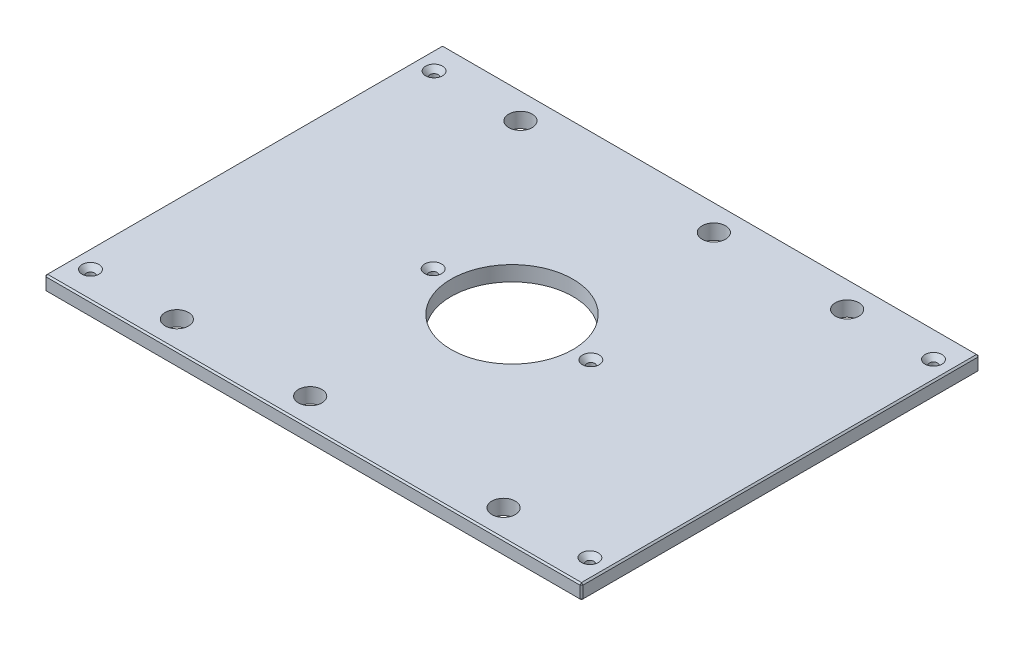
ISO-10303-21;
HEADER;
FILE_DESCRIPTION(('STEP AP214'),'2;1');
FILE_NAME('part.step','',(''),(''),'','','');
FILE_SCHEMA(('AUTOMOTIVE_DESIGN { 1 0 10303 214 1 1 1 1 }'));
ENDSEC;
DATA;
#1=APPLICATION_CONTEXT('core data for automotive mechanical design processes');
#2=APPLICATION_PROTOCOL_DEFINITION('international standard','automotive_design',2000,#1);
#3=PRODUCT_CONTEXT('',#1,'mechanical');
#4=PRODUCT('Part','Part','',(#3));
#5=PRODUCT_RELATED_PRODUCT_CATEGORY('part','',(#4));
#6=PRODUCT_DEFINITION_FORMATION('','',#4);
#7=PRODUCT_DEFINITION_CONTEXT('part definition',#1,'design');
#8=PRODUCT_DEFINITION('design','',#6,#7);
#9=PRODUCT_DEFINITION_SHAPE('','',#8);
#10=(LENGTH_UNIT() NAMED_UNIT(*) SI_UNIT(.MILLI.,.METRE.));
#11=(NAMED_UNIT(*) PLANE_ANGLE_UNIT() SI_UNIT($,.RADIAN.));
#12=(NAMED_UNIT(*) SI_UNIT($,.STERADIAN.) SOLID_ANGLE_UNIT());
#13=UNCERTAINTY_MEASURE_WITH_UNIT(LENGTH_MEASURE(1.E-05),#10,'distance_accuracy_value','');
#14=(GEOMETRIC_REPRESENTATION_CONTEXT(3) GLOBAL_UNCERTAINTY_ASSIGNED_CONTEXT((#13)) GLOBAL_UNIT_ASSIGNED_CONTEXT((#10,
#11,#12)) REPRESENTATION_CONTEXT('',''));
#15=CARTESIAN_POINT('',(0.,0.,0.));
#16=DIRECTION('',(0.,0.,1.));
#17=DIRECTION('',(1.,0.,0.));
#18=AXIS2_PLACEMENT_3D('',#15,#16,#17);
#19=CARTESIAN_POINT('',(-227.0125,12.7,-168.275));
#20=DIRECTION('',(1.,0.,0.));
#21=DIRECTION('',(0.,0.,-1.));
#22=AXIS2_PLACEMENT_3D('',#19,#20,#21);
#23=PLANE('',#22);
#24=DIRECTION('',(0.,0.,-1.));
#25=VECTOR('',#24,1.);
#26=CARTESIAN_POINT('',(-227.0125,11.4299999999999,-168.275));
#27=LINE('',#26,#25);
#28=CARTESIAN_POINT('',(-227.0125,11.4299999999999,167.005));
#29=VERTEX_POINT('',#28);
#30=CARTESIAN_POINT('',(-227.0125,11.4299999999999,-167.005));
#31=VERTEX_POINT('',#30);
#32=EDGE_CURVE('E134',#29,#31,#27,.T.);
#33=ORIENTED_EDGE('',*,*,#32,.T.);
#34=DIRECTION('',(0.,-1.,0.));
#35=VECTOR('',#34,1.);
#36=CARTESIAN_POINT('',(-227.0125,12.7,-167.005));
#37=LINE('',#36,#35);
#38=CARTESIAN_POINT('',(-227.0125,1.27000000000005,-167.005));
#39=VERTEX_POINT('',#38);
#40=EDGE_CURVE('E130',#31,#39,#37,.T.);
#41=ORIENTED_EDGE('',*,*,#40,.T.);
#42=DIRECTION('',(0.,0.,1.));
#43=VECTOR('',#42,1.);
#44=CARTESIAN_POINT('',(-227.0125,1.27000000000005,-168.275));
#45=LINE('',#44,#43);
#46=CARTESIAN_POINT('',(-227.0125,1.27000000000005,167.005));
#47=VERTEX_POINT('',#46);
#48=EDGE_CURVE('E125',#39,#47,#45,.T.);
#49=ORIENTED_EDGE('',*,*,#48,.T.);
#50=DIRECTION('',(0.,1.,0.));
#51=VECTOR('',#50,1.);
#52=CARTESIAN_POINT('',(-227.0125,12.7,167.005));
#53=LINE('',#52,#51);
#54=EDGE_CURVE('E127',#47,#29,#53,.T.);
#55=ORIENTED_EDGE('',*,*,#54,.T.);
#56=EDGE_LOOP('',(#33,#41,#49,#55));
#57=FACE_BOUND('',#56,.T.);
#58=ADVANCED_FACE('F34',(#57),#23,.F.);
#59=CARTESIAN_POINT('',(-227.0125,12.7,168.275));
#60=DIRECTION('',(0.,0.,-1.));
#61=DIRECTION('',(-1.,0.,0.));
#62=AXIS2_PLACEMENT_3D('',#59,#60,#61);
#63=PLANE('',#62);
#64=DIRECTION('',(1.,0.,0.));
#65=VECTOR('',#64,1.);
#66=CARTESIAN_POINT('',(-227.0125,1.27000000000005,168.275));
#67=LINE('',#66,#65);
#68=CARTESIAN_POINT('',(-225.7425,1.27000000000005,168.275));
#69=VERTEX_POINT('',#68);
#70=CARTESIAN_POINT('',(225.7425,1.27000000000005,168.275));
#71=VERTEX_POINT('',#70);
#72=EDGE_CURVE('E57',#69,#71,#67,.T.);
#73=ORIENTED_EDGE('',*,*,#72,.T.);
#74=DIRECTION('',(0.,1.,0.));
#75=VECTOR('',#74,1.);
#76=CARTESIAN_POINT('',(225.7425,12.7,168.275));
#77=LINE('',#76,#75);
#78=CARTESIAN_POINT('',(225.7425,11.4299999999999,168.275));
#79=VERTEX_POINT('',#78);
#80=EDGE_CURVE('E11',#71,#79,#77,.T.);
#81=ORIENTED_EDGE('',*,*,#80,.T.);
#82=DIRECTION('',(-1.,0.,0.));
#83=VECTOR('',#82,1.);
#84=CARTESIAN_POINT('',(-227.0125,11.4299999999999,168.275));
#85=LINE('',#84,#83);
#86=CARTESIAN_POINT('',(-225.7425,11.4299999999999,168.275));
#87=VERTEX_POINT('',#86);
#88=EDGE_CURVE('E43',#79,#87,#85,.T.);
#89=ORIENTED_EDGE('',*,*,#88,.T.);
#90=DIRECTION('',(0.,-1.,0.));
#91=VECTOR('',#90,1.);
#92=CARTESIAN_POINT('',(-225.7425,12.7,168.275));
#93=LINE('',#92,#91);
#94=EDGE_CURVE('E290',#87,#69,#93,.T.);
#95=ORIENTED_EDGE('',*,*,#94,.T.);
#96=EDGE_LOOP('',(#73,#81,#89,#95));
#97=FACE_BOUND('',#96,.T.);
#98=ADVANCED_FACE('F359',(#97),#63,.F.);
#99=CARTESIAN_POINT('',(227.0125,12.7,-168.275));
#100=DIRECTION('',(-1.,0.,0.));
#101=DIRECTION('',(0.,0.,1.));
#102=AXIS2_PLACEMENT_3D('',#99,#100,#101);
#103=PLANE('',#102);
#104=DIRECTION('',(0.,0.,-1.));
#105=VECTOR('',#104,1.);
#106=CARTESIAN_POINT('',(227.0125,1.27000000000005,-168.275));
#107=LINE('',#106,#105);
#108=CARTESIAN_POINT('',(227.0125,1.27000000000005,167.005));
#109=VERTEX_POINT('',#108);
#110=CARTESIAN_POINT('',(227.0125,1.27000000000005,-167.005));
#111=VERTEX_POINT('',#110);
#112=EDGE_CURVE('E285',#109,#111,#107,.T.);
#113=ORIENTED_EDGE('',*,*,#112,.T.);
#114=DIRECTION('',(0.,1.,0.));
#115=VECTOR('',#114,1.);
#116=CARTESIAN_POINT('',(227.0125,12.7,-167.005));
#117=LINE('',#116,#115);
#118=CARTESIAN_POINT('',(227.0125,11.4299999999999,-167.005));
#119=VERTEX_POINT('',#118);
#120=EDGE_CURVE('E287',#111,#119,#117,.T.);
#121=ORIENTED_EDGE('',*,*,#120,.T.);
#122=DIRECTION('',(0.,0.,1.));
#123=VECTOR('',#122,1.);
#124=CARTESIAN_POINT('',(227.0125,11.4299999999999,168.275));
#125=LINE('',#124,#123);
#126=CARTESIAN_POINT('',(227.0125,11.4299999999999,167.005));
#127=VERTEX_POINT('',#126);
#128=EDGE_CURVE('E283',#119,#127,#125,.T.);
#129=ORIENTED_EDGE('',*,*,#128,.T.);
#130=DIRECTION('',(0.,-1.,0.));
#131=VECTOR('',#130,1.);
#132=CARTESIAN_POINT('',(227.0125,12.7,167.005));
#133=LINE('',#132,#131);
#134=EDGE_CURVE('E281',#127,#109,#133,.T.);
#135=ORIENTED_EDGE('',*,*,#134,.T.);
#136=EDGE_LOOP('',(#113,#121,#129,#135));
#137=FACE_BOUND('',#136,.T.);
#138=ADVANCED_FACE('F346',(#137),#103,.F.);
#139=CARTESIAN_POINT('',(-227.0125,12.7,-168.275));
#140=DIRECTION('',(0.,0.,1.));
#141=DIRECTION('',(1.,0.,0.));
#142=AXIS2_PLACEMENT_3D('',#139,#140,#141);
#143=PLANE('',#142);
#144=DIRECTION('',(-1.,0.,0.));
#145=VECTOR('',#144,1.);
#146=CARTESIAN_POINT('',(-227.0125,1.27000000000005,-168.275));
#147=LINE('',#146,#145);
#148=CARTESIAN_POINT('',(225.7425,1.27000000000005,-168.275));
#149=VERTEX_POINT('',#148);
#150=CARTESIAN_POINT('',(-225.7425,1.27000000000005,-168.275));
#151=VERTEX_POINT('',#150);
#152=EDGE_CURVE('E257',#149,#151,#147,.T.);
#153=ORIENTED_EDGE('',*,*,#152,.T.);
#154=DIRECTION('',(0.,1.,0.));
#155=VECTOR('',#154,1.);
#156=CARTESIAN_POINT('',(-225.7425,12.7,-168.275));
#157=LINE('',#156,#155);
#158=CARTESIAN_POINT('',(-225.7425,11.4299999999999,-168.275));
#159=VERTEX_POINT('',#158);
#160=EDGE_CURVE('E261',#151,#159,#157,.T.);
#161=ORIENTED_EDGE('',*,*,#160,.T.);
#162=DIRECTION('',(1.,0.,0.));
#163=VECTOR('',#162,1.);
#164=CARTESIAN_POINT('',(227.0125,11.4299999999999,-168.275));
#165=LINE('',#164,#163);
#166=CARTESIAN_POINT('',(225.7425,11.4299999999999,-168.275));
#167=VERTEX_POINT('',#166);
#168=EDGE_CURVE('E259',#159,#167,#165,.T.);
#169=ORIENTED_EDGE('',*,*,#168,.T.);
#170=DIRECTION('',(0.,-1.,0.));
#171=VECTOR('',#170,1.);
#172=CARTESIAN_POINT('',(225.7425,12.7,-168.275));
#173=LINE('',#172,#171);
#174=EDGE_CURVE('E255',#167,#149,#173,.T.);
#175=ORIENTED_EDGE('',*,*,#174,.T.);
#176=EDGE_LOOP('',(#153,#161,#169,#175));
#177=FACE_BOUND('',#176,.T.);
#178=ADVANCED_FACE('F320',(#177),#143,.F.);
#179=CARTESIAN_POINT('',(0.,12.7,0.));
#180=DIRECTION('',(0.,1.,0.));
#181=DIRECTION('',(0.,0.,1.));
#182=AXIS2_PLACEMENT_3D('',#179,#180,#181);
#183=PLANE('',#182);
#184=CARTESIAN_POINT('',(211.1375,12.7,-145.25498));
#185=DIRECTION('',(0.,1.,0.));
#186=DIRECTION('',(0.,0.,1.));
#187=AXIS2_PLACEMENT_3D('',#184,#185,#186);
#188=CIRCLE('',#187,7.13739999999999);
#189=CARTESIAN_POINT('',(211.1375,12.7,-138.11758));
#190=VERTEX_POINT('',#189);
#191=EDGE_CURVE('E783',#190,#190,#188,.T.);
#192=ORIENTED_EDGE('',*,*,#191,.F.);
#193=EDGE_LOOP('',(#192));
#194=FACE_BOUND('',#193,.T.);
#195=CARTESIAN_POINT('',(211.1375,12.7,145.25498));
#196=DIRECTION('',(0.,1.,0.));
#197=DIRECTION('',(0.,0.,1.));
#198=AXIS2_PLACEMENT_3D('',#195,#196,#197);
#199=CIRCLE('',#198,7.13739999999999);
#200=CARTESIAN_POINT('',(211.1375,12.7,152.39238));
#201=VERTEX_POINT('',#200);
#202=EDGE_CURVE('E787',#201,#201,#199,.T.);
#203=ORIENTED_EDGE('',*,*,#202,.F.);
#204=EDGE_LOOP('',(#203));
#205=FACE_BOUND('',#204,.T.);
#206=CARTESIAN_POINT('',(-211.1375,12.7,145.25498));
#207=DIRECTION('',(0.,1.,0.));
#208=DIRECTION('',(0.,0.,1.));
#209=AXIS2_PLACEMENT_3D('',#206,#207,#208);
#210=CIRCLE('',#209,7.13739999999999);
#211=CARTESIAN_POINT('',(-211.1375,12.7,152.39238));
#212=VERTEX_POINT('',#211);
#213=EDGE_CURVE('E791',#212,#212,#210,.T.);
#214=ORIENTED_EDGE('',*,*,#213,.F.);
#215=EDGE_LOOP('',(#214));
#216=FACE_BOUND('',#215,.T.);
#217=CARTESIAN_POINT('',(-66.675,12.7,0.));
#218=DIRECTION('',(0.,1.,0.));
#219=DIRECTION('',(0.,0.,1.));
#220=AXIS2_PLACEMENT_3D('',#217,#218,#219);
#221=CIRCLE('',#220,7.1374);
#222=CARTESIAN_POINT('',(-66.675,12.7,7.1374));
#223=VERTEX_POINT('',#222);
#224=EDGE_CURVE('E795',#223,#223,#221,.T.);
#225=ORIENTED_EDGE('',*,*,#224,.F.);
#226=EDGE_LOOP('',(#225));
#227=FACE_BOUND('',#226,.T.);
#228=CARTESIAN_POINT('',(66.675,12.7,0.));
#229=DIRECTION('',(0.,1.,0.));
#230=DIRECTION('',(0.,0.,1.));
#231=AXIS2_PLACEMENT_3D('',#228,#229,#230);
#232=CIRCLE('',#231,7.1374);
#233=CARTESIAN_POINT('',(66.675,12.7,7.1374));
#234=VERTEX_POINT('',#233);
#235=EDGE_CURVE('E799',#234,#234,#232,.T.);
#236=ORIENTED_EDGE('',*,*,#235,.F.);
#237=EDGE_LOOP('',(#236));
#238=FACE_BOUND('',#237,.T.);
#239=CARTESIAN_POINT('',(-211.1375,12.7,-145.25498));
#240=DIRECTION('',(0.,1.,0.));
#241=DIRECTION('',(0.,0.,1.));
#242=AXIS2_PLACEMENT_3D('',#239,#240,#241);
#243=CIRCLE('',#242,7.13739999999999);
#244=CARTESIAN_POINT('',(-211.1375,12.7,-138.11758));
#245=VERTEX_POINT('',#244);
#246=EDGE_CURVE('E802',#245,#245,#243,.T.);
#247=ORIENTED_EDGE('',*,*,#246,.F.);
#248=EDGE_LOOP('',(#247));
#249=FACE_BOUND('',#248,.T.);
#250=DIRECTION('',(0.,0.,-1.));
#251=VECTOR('',#250,1.);
#252=CARTESIAN_POINT('',(225.7425,12.7,-168.275));
#253=LINE('',#252,#251);
#254=CARTESIAN_POINT('',(225.7425,12.7,167.005));
#255=VERTEX_POINT('',#254);
#256=CARTESIAN_POINT('',(225.7425,12.7,-167.005));
#257=VERTEX_POINT('',#256);
#258=EDGE_CURVE('E268',#255,#257,#253,.T.);
#259=ORIENTED_EDGE('',*,*,#258,.T.);
#260=DIRECTION('',(-1.,0.,0.));
#261=VECTOR('',#260,1.);
#262=CARTESIAN_POINT('',(-227.0125,12.7,-167.005));
#263=LINE('',#262,#261);
#264=CARTESIAN_POINT('',(-225.7425,12.7,-167.005));
#265=VERTEX_POINT('',#264);
#266=EDGE_CURVE('E270',#257,#265,#263,.T.);
#267=ORIENTED_EDGE('',*,*,#266,.T.);
#268=DIRECTION('',(0.,0.,1.));
#269=VECTOR('',#268,1.);
#270=CARTESIAN_POINT('',(-225.7425,12.7,168.275));
#271=LINE('',#270,#269);
#272=CARTESIAN_POINT('',(-225.7425,12.7,167.005));
#273=VERTEX_POINT('',#272);
#274=EDGE_CURVE('E266',#265,#273,#271,.T.);
#275=ORIENTED_EDGE('',*,*,#274,.T.);
#276=DIRECTION('',(1.,0.,0.));
#277=VECTOR('',#276,1.);
#278=CARTESIAN_POINT('',(227.0125,12.7,167.005));
#279=LINE('',#278,#277);
#280=EDGE_CURVE('E264',#273,#255,#279,.T.);
#281=ORIENTED_EDGE('',*,*,#280,.T.);
#282=EDGE_LOOP('',(#259,#267,#275,#281));
#283=FACE_BOUND('',#282,.T.);
#284=CARTESIAN_POINT('',(138.1125,12.7,-145.25498));
#285=DIRECTION('',(0.,1.,0.));
#286=DIRECTION('',(0.,0.,1.));
#287=AXIS2_PLACEMENT_3D('',#284,#285,#286);
#288=CIRCLE('',#287,9.921875);
#289=CARTESIAN_POINT('',(138.1125,12.7,-135.333105));
#290=VERTEX_POINT('',#289);
#291=EDGE_CURVE('E203',#290,#290,#288,.T.);
#292=ORIENTED_EDGE('',*,*,#291,.F.);
#293=EDGE_LOOP('',(#292));
#294=FACE_BOUND('',#293,.T.);
#295=CARTESIAN_POINT('',(-138.1125,12.7,-145.25498));
#296=DIRECTION('',(0.,1.,0.));
#297=DIRECTION('',(0.,0.,1.));
#298=AXIS2_PLACEMENT_3D('',#295,#296,#297);
#299=CIRCLE('',#298,9.921875);
#300=CARTESIAN_POINT('',(-138.1125,12.7,-135.333105));
#301=VERTEX_POINT('',#300);
#302=EDGE_CURVE('E213',#301,#301,#299,.T.);
#303=ORIENTED_EDGE('',*,*,#302,.F.);
#304=EDGE_LOOP('',(#303));
#305=FACE_BOUND('',#304,.T.);
#306=CARTESIAN_POINT('',(138.1125,12.7,145.25498));
#307=DIRECTION('',(0.,1.,0.));
#308=DIRECTION('',(0.,0.,1.));
#309=AXIS2_PLACEMENT_3D('',#306,#307,#308);
#310=CIRCLE('',#309,9.921875);
#311=CARTESIAN_POINT('',(138.1125,12.7,155.176855));
#312=VERTEX_POINT('',#311);
#313=EDGE_CURVE('E224',#312,#312,#310,.T.);
#314=ORIENTED_EDGE('',*,*,#313,.F.);
#315=EDGE_LOOP('',(#314));
#316=FACE_BOUND('',#315,.T.);
#317=CARTESIAN_POINT('',(-138.1125,12.7,145.25498));
#318=DIRECTION('',(0.,1.,0.));
#319=DIRECTION('',(0.,0.,1.));
#320=AXIS2_PLACEMENT_3D('',#317,#318,#319);
#321=CIRCLE('',#320,9.921875);
#322=CARTESIAN_POINT('',(-138.1125,12.7,155.176855));
#323=VERTEX_POINT('',#322);
#324=EDGE_CURVE('E230',#323,#323,#321,.T.);
#325=ORIENTED_EDGE('',*,*,#324,.F.);
#326=EDGE_LOOP('',(#325));
#327=FACE_BOUND('',#326,.T.);
#328=CARTESIAN_POINT('',(25.4,12.7,-145.25498));
#329=DIRECTION('',(0.,1.,0.));
#330=DIRECTION('',(0.,0.,1.));
#331=AXIS2_PLACEMENT_3D('',#328,#329,#330);
#332=CIRCLE('',#331,9.921875);
#333=CARTESIAN_POINT('',(25.4,12.7,-135.333105));
#334=VERTEX_POINT('',#333);
#335=EDGE_CURVE('E236',#334,#334,#332,.T.);
#336=ORIENTED_EDGE('',*,*,#335,.F.);
#337=EDGE_LOOP('',(#336));
#338=FACE_BOUND('',#337,.T.);
#339=CARTESIAN_POINT('',(-25.4,12.7,145.25498));
#340=DIRECTION('',(0.,1.,0.));
#341=DIRECTION('',(0.,0.,1.));
#342=AXIS2_PLACEMENT_3D('',#339,#340,#341);
#343=CIRCLE('',#342,9.921875);
#344=CARTESIAN_POINT('',(-25.4,12.7,155.176855));
#345=VERTEX_POINT('',#344);
#346=EDGE_CURVE('E242',#345,#345,#343,.T.);
#347=ORIENTED_EDGE('',*,*,#346,.F.);
#348=EDGE_LOOP('',(#347));
#349=FACE_BOUND('',#348,.T.);
#350=CARTESIAN_POINT('',(0.,12.7,0.));
#351=DIRECTION('',(0.,1.,0.));
#352=DIRECTION('',(0.,0.,1.));
#353=AXIS2_PLACEMENT_3D('',#350,#351,#352);
#354=CIRCLE('',#353,51.562);
#355=CARTESIAN_POINT('',(0.,12.7,51.562));
#356=VERTEX_POINT('',#355);
#357=EDGE_CURVE('E248',#356,#356,#354,.T.);
#358=ORIENTED_EDGE('',*,*,#357,.F.);
#359=EDGE_LOOP('',(#358));
#360=FACE_BOUND('',#359,.T.);
#361=ADVANCED_FACE('F368',(#194,#205,#216,#227,#238,#249,#283,#294,#305,#316,#327,#338,#349,
#360),#183,.T.);
#362=CARTESIAN_POINT('',(0.,0.,0.));
#363=DIRECTION('',(0.,1.,0.));
#364=DIRECTION('',(0.,0.,1.));
#365=AXIS2_PLACEMENT_3D('',#362,#363,#364);
#366=PLANE('',#365);
#367=CARTESIAN_POINT('',(211.1375,0.,-145.25498));
#368=DIRECTION('',(0.,1.,0.));
#369=DIRECTION('',(0.,0.,1.));
#370=AXIS2_PLACEMENT_3D('',#367,#368,#369);
#371=CIRCLE('',#370,3.3782);
#372=CARTESIAN_POINT('',(211.1375,0.,-141.87678));
#373=VERTEX_POINT('',#372);
#374=EDGE_CURVE('E836',#373,#373,#371,.T.);
#375=ORIENTED_EDGE('',*,*,#374,.T.);
#376=EDGE_LOOP('',(#375));
#377=FACE_BOUND('',#376,.T.);
#378=CARTESIAN_POINT('',(211.1375,0.,145.25498));
#379=DIRECTION('',(0.,1.,0.));
#380=DIRECTION('',(0.,0.,1.));
#381=AXIS2_PLACEMENT_3D('',#378,#379,#380);
#382=CIRCLE('',#381,3.3782);
#383=CARTESIAN_POINT('',(211.1375,0.,148.63318));
#384=VERTEX_POINT('',#383);
#385=EDGE_CURVE('E829',#384,#384,#382,.T.);
#386=ORIENTED_EDGE('',*,*,#385,.T.);
#387=EDGE_LOOP('',(#386));
#388=FACE_BOUND('',#387,.T.);
#389=CARTESIAN_POINT('',(-211.1375,0.,145.25498));
#390=DIRECTION('',(0.,1.,0.));
#391=DIRECTION('',(0.,0.,1.));
#392=AXIS2_PLACEMENT_3D('',#389,#390,#391);
#393=CIRCLE('',#392,3.3782);
#394=CARTESIAN_POINT('',(-211.1375,0.,148.63318));
#395=VERTEX_POINT('',#394);
#396=EDGE_CURVE('E822',#395,#395,#393,.T.);
#397=ORIENTED_EDGE('',*,*,#396,.T.);
#398=EDGE_LOOP('',(#397));
#399=FACE_BOUND('',#398,.T.);
#400=CARTESIAN_POINT('',(-66.675,0.,0.));
#401=DIRECTION('',(0.,1.,0.));
#402=DIRECTION('',(0.,0.,1.));
#403=AXIS2_PLACEMENT_3D('',#400,#401,#402);
#404=CIRCLE('',#403,3.3782);
#405=CARTESIAN_POINT('',(-66.675,0.,3.3782));
#406=VERTEX_POINT('',#405);
#407=EDGE_CURVE('E815',#406,#406,#404,.T.);
#408=ORIENTED_EDGE('',*,*,#407,.T.);
#409=EDGE_LOOP('',(#408));
#410=FACE_BOUND('',#409,.T.);
#411=CARTESIAN_POINT('',(66.675,0.,0.));
#412=DIRECTION('',(0.,1.,0.));
#413=DIRECTION('',(0.,0.,1.));
#414=AXIS2_PLACEMENT_3D('',#411,#412,#413);
#415=CIRCLE('',#414,3.3782);
#416=CARTESIAN_POINT('',(66.675,0.,3.3782));
#417=VERTEX_POINT('',#416);
#418=EDGE_CURVE('E805',#417,#417,#415,.T.);
#419=ORIENTED_EDGE('',*,*,#418,.T.);
#420=EDGE_LOOP('',(#419));
#421=FACE_BOUND('',#420,.T.);
#422=CARTESIAN_POINT('',(-211.1375,0.,-145.25498));
#423=DIRECTION('',(0.,1.,0.));
#424=DIRECTION('',(0.,0.,1.));
#425=AXIS2_PLACEMENT_3D('',#422,#423,#424);
#426=CIRCLE('',#425,3.3782);
#427=CARTESIAN_POINT('',(-211.1375,0.,-141.87678));
#428=VERTEX_POINT('',#427);
#429=EDGE_CURVE('E216',#428,#428,#426,.T.);
#430=ORIENTED_EDGE('',*,*,#429,.T.);
#431=EDGE_LOOP('',(#430));
#432=FACE_BOUND('',#431,.T.);
#433=DIRECTION('',(0.,0.,-1.));
#434=VECTOR('',#433,1.);
#435=CARTESIAN_POINT('',(-225.7425,0.,0.));
#436=LINE('',#435,#434);
#437=CARTESIAN_POINT('',(-225.7425,0.,167.005));
#438=VERTEX_POINT('',#437);
#439=CARTESIAN_POINT('',(-225.7425,0.,-167.005));
#440=VERTEX_POINT('',#439);
#441=EDGE_CURVE('E157',#438,#440,#436,.T.);
#442=ORIENTED_EDGE('',*,*,#441,.T.);
#443=DIRECTION('',(1.,0.,0.));
#444=VECTOR('',#443,1.);
#445=CARTESIAN_POINT('',(0.,0.,-167.005));
#446=LINE('',#445,#444);
#447=CARTESIAN_POINT('',(225.7425,0.,-167.005));
#448=VERTEX_POINT('',#447);
#449=EDGE_CURVE('E278',#440,#448,#446,.T.);
#450=ORIENTED_EDGE('',*,*,#449,.T.);
#451=DIRECTION('',(0.,0.,1.));
#452=VECTOR('',#451,1.);
#453=CARTESIAN_POINT('',(225.7425,0.,0.));
#454=LINE('',#453,#452);
#455=CARTESIAN_POINT('',(225.7425,0.,167.005));
#456=VERTEX_POINT('',#455);
#457=EDGE_CURVE('E276',#448,#456,#454,.T.);
#458=ORIENTED_EDGE('',*,*,#457,.T.);
#459=DIRECTION('',(-1.,0.,0.));
#460=VECTOR('',#459,1.);
#461=CARTESIAN_POINT('',(0.,0.,167.005));
#462=LINE('',#461,#460);
#463=EDGE_CURVE('E273',#456,#438,#462,.T.);
#464=ORIENTED_EDGE('',*,*,#463,.T.);
#465=EDGE_LOOP('',(#442,#450,#458,#464));
#466=FACE_BOUND('',#465,.T.);
#467=CARTESIAN_POINT('',(138.1125,0.,-145.25498));
#468=DIRECTION('',(0.,1.,0.));
#469=DIRECTION('',(0.,0.,1.));
#470=AXIS2_PLACEMENT_3D('',#467,#468,#469);
#471=CIRCLE('',#470,9.921875);
#472=CARTESIAN_POINT('',(138.1125,0.,-135.333105));
#473=VERTEX_POINT('',#472);
#474=EDGE_CURVE('E208',#473,#473,#471,.T.);
#475=ORIENTED_EDGE('',*,*,#474,.T.);
#476=EDGE_LOOP('',(#475));
#477=FACE_BOUND('',#476,.T.);
#478=CARTESIAN_POINT('',(-138.1125,0.,-145.25498));
#479=DIRECTION('',(0.,1.,0.));
#480=DIRECTION('',(0.,0.,1.));
#481=AXIS2_PLACEMENT_3D('',#478,#479,#480);
#482=CIRCLE('',#481,9.921875);
#483=CARTESIAN_POINT('',(-138.1125,0.,-135.333105));
#484=VERTEX_POINT('',#483);
#485=EDGE_CURVE('E221',#484,#484,#482,.T.);
#486=ORIENTED_EDGE('',*,*,#485,.T.);
#487=EDGE_LOOP('',(#486));
#488=FACE_BOUND('',#487,.T.);
#489=CARTESIAN_POINT('',(138.1125,0.,145.25498));
#490=DIRECTION('',(0.,1.,0.));
#491=DIRECTION('',(0.,0.,1.));
#492=AXIS2_PLACEMENT_3D('',#489,#490,#491);
#493=CIRCLE('',#492,9.921875);
#494=CARTESIAN_POINT('',(138.1125,0.,155.176855));
#495=VERTEX_POINT('',#494);
#496=EDGE_CURVE('E227',#495,#495,#493,.T.);
#497=ORIENTED_EDGE('',*,*,#496,.T.);
#498=EDGE_LOOP('',(#497));
#499=FACE_BOUND('',#498,.T.);
#500=CARTESIAN_POINT('',(-138.1125,0.,145.25498));
#501=DIRECTION('',(0.,1.,0.));
#502=DIRECTION('',(0.,0.,1.));
#503=AXIS2_PLACEMENT_3D('',#500,#501,#502);
#504=CIRCLE('',#503,9.921875);
#505=CARTESIAN_POINT('',(-138.1125,0.,155.176855));
#506=VERTEX_POINT('',#505);
#507=EDGE_CURVE('E233',#506,#506,#504,.T.);
#508=ORIENTED_EDGE('',*,*,#507,.T.);
#509=EDGE_LOOP('',(#508));
#510=FACE_BOUND('',#509,.T.);
#511=CARTESIAN_POINT('',(25.4,0.,-145.25498));
#512=DIRECTION('',(0.,1.,0.));
#513=DIRECTION('',(0.,0.,1.));
#514=AXIS2_PLACEMENT_3D('',#511,#512,#513);
#515=CIRCLE('',#514,9.921875);
#516=CARTESIAN_POINT('',(25.4,0.,-135.333105));
#517=VERTEX_POINT('',#516);
#518=EDGE_CURVE('E239',#517,#517,#515,.T.);
#519=ORIENTED_EDGE('',*,*,#518,.T.);
#520=EDGE_LOOP('',(#519));
#521=FACE_BOUND('',#520,.T.);
#522=CARTESIAN_POINT('',(-25.4,0.,145.25498));
#523=DIRECTION('',(0.,1.,0.));
#524=DIRECTION('',(0.,0.,1.));
#525=AXIS2_PLACEMENT_3D('',#522,#523,#524);
#526=CIRCLE('',#525,9.921875);
#527=CARTESIAN_POINT('',(-25.4,0.,155.176855));
#528=VERTEX_POINT('',#527);
#529=EDGE_CURVE('E245',#528,#528,#526,.T.);
#530=ORIENTED_EDGE('',*,*,#529,.T.);
#531=EDGE_LOOP('',(#530));
#532=FACE_BOUND('',#531,.T.);
#533=CARTESIAN_POINT('',(0.,0.,0.));
#534=DIRECTION('',(0.,1.,0.));
#535=DIRECTION('',(0.,0.,1.));
#536=AXIS2_PLACEMENT_3D('',#533,#534,#535);
#537=CIRCLE('',#536,51.562);
#538=CARTESIAN_POINT('',(0.,0.,51.562));
#539=VERTEX_POINT('',#538);
#540=EDGE_CURVE('E146',#539,#539,#537,.T.);
#541=ORIENTED_EDGE('',*,*,#540,.T.);
#542=EDGE_LOOP('',(#541));
#543=FACE_BOUND('',#542,.T.);
#544=ADVANCED_FACE('F333',(#377,#388,#399,#410,#421,#432,#466,#477,#488,#499,#510,#521,#532,
#543),#366,.F.);
#545=CARTESIAN_POINT('',(0.,0.,0.));
#546=DIRECTION('',(0.,1.,0.));
#547=DIRECTION('',(0.,0.,1.));
#548=AXIS2_PLACEMENT_3D('',#545,#546,#547);
#549=CYLINDRICAL_SURFACE('',#548,51.562);
#550=ORIENTED_EDGE('',*,*,#540,.F.);
#551=EDGE_LOOP('',(#550));
#552=FACE_BOUND('',#551,.T.);
#553=ORIENTED_EDGE('',*,*,#357,.T.);
#554=EDGE_LOOP('',(#553));
#555=FACE_BOUND('',#554,.T.);
#556=ADVANCED_FACE('F720',(#552,#555),#549,.F.);
#557=CARTESIAN_POINT('',(-25.4,12.7,145.25498));
#558=DIRECTION('',(0.,1.,0.));
#559=DIRECTION('',(0.,0.,1.));
#560=AXIS2_PLACEMENT_3D('',#557,#558,#559);
#561=CYLINDRICAL_SURFACE('',#560,9.921875);
#562=ORIENTED_EDGE('',*,*,#529,.F.);
#563=EDGE_LOOP('',(#562));
#564=FACE_BOUND('',#563,.T.);
#565=ORIENTED_EDGE('',*,*,#346,.T.);
#566=EDGE_LOOP('',(#565));
#567=FACE_BOUND('',#566,.T.);
#568=ADVANCED_FACE('F711',(#564,#567),#561,.F.);
#569=CARTESIAN_POINT('',(25.4,12.7,-145.25498));
#570=DIRECTION('',(0.,1.,0.));
#571=DIRECTION('',(0.,0.,1.));
#572=AXIS2_PLACEMENT_3D('',#569,#570,#571);
#573=CYLINDRICAL_SURFACE('',#572,9.921875);
#574=ORIENTED_EDGE('',*,*,#518,.F.);
#575=EDGE_LOOP('',(#574));
#576=FACE_BOUND('',#575,.T.);
#577=ORIENTED_EDGE('',*,*,#335,.T.);
#578=EDGE_LOOP('',(#577));
#579=FACE_BOUND('',#578,.T.);
#580=ADVANCED_FACE('F702',(#576,#579),#573,.F.);
#581=CARTESIAN_POINT('',(-138.1125,12.7,145.25498));
#582=DIRECTION('',(0.,1.,0.));
#583=DIRECTION('',(0.,0.,1.));
#584=AXIS2_PLACEMENT_3D('',#581,#582,#583);
#585=CYLINDRICAL_SURFACE('',#584,9.921875);
#586=ORIENTED_EDGE('',*,*,#507,.F.);
#587=EDGE_LOOP('',(#586));
#588=FACE_BOUND('',#587,.T.);
#589=ORIENTED_EDGE('',*,*,#324,.T.);
#590=EDGE_LOOP('',(#589));
#591=FACE_BOUND('',#590,.T.);
#592=ADVANCED_FACE('F693',(#588,#591),#585,.F.);
#593=CARTESIAN_POINT('',(138.1125,12.7,145.25498));
#594=DIRECTION('',(0.,1.,0.));
#595=DIRECTION('',(0.,0.,1.));
#596=AXIS2_PLACEMENT_3D('',#593,#594,#595);
#597=CYLINDRICAL_SURFACE('',#596,9.921875);
#598=ORIENTED_EDGE('',*,*,#496,.F.);
#599=EDGE_LOOP('',(#598));
#600=FACE_BOUND('',#599,.T.);
#601=ORIENTED_EDGE('',*,*,#313,.T.);
#602=EDGE_LOOP('',(#601));
#603=FACE_BOUND('',#602,.T.);
#604=ADVANCED_FACE('F684',(#600,#603),#597,.F.);
#605=CARTESIAN_POINT('',(-138.1125,12.7,-145.25498));
#606=DIRECTION('',(0.,1.,0.));
#607=DIRECTION('',(0.,0.,1.));
#608=AXIS2_PLACEMENT_3D('',#605,#606,#607);
#609=CYLINDRICAL_SURFACE('',#608,9.921875);
#610=ORIENTED_EDGE('',*,*,#485,.F.);
#611=EDGE_LOOP('',(#610));
#612=FACE_BOUND('',#611,.T.);
#613=ORIENTED_EDGE('',*,*,#302,.T.);
#614=EDGE_LOOP('',(#613));
#615=FACE_BOUND('',#614,.T.);
#616=ADVANCED_FACE('F674',(#612,#615),#609,.F.);
#617=CARTESIAN_POINT('',(138.1125,12.7,-145.25498));
#618=DIRECTION('',(0.,1.,0.));
#619=DIRECTION('',(0.,0.,1.));
#620=AXIS2_PLACEMENT_3D('',#617,#618,#619);
#621=CYLINDRICAL_SURFACE('',#620,9.921875);
#622=ORIENTED_EDGE('',*,*,#474,.F.);
#623=EDGE_LOOP('',(#622));
#624=FACE_BOUND('',#623,.T.);
#625=ORIENTED_EDGE('',*,*,#291,.T.);
#626=EDGE_LOOP('',(#625));
#627=FACE_BOUND('',#626,.T.);
#628=ADVANCED_FACE('F377',(#624,#627),#621,.F.);
#629=CARTESIAN_POINT('',(227.0125,12.7,167.005));
#630=DIRECTION('',(-0.707106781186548,0.,-0.707106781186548));
#631=DIRECTION('',(0.,-1.,0.));
#632=AXIS2_PLACEMENT_3D('',#629,#630,#631);
#633=PLANE('',#632);
#634=DIRECTION('',(-0.707106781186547,0.,0.707106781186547));
#635=VECTOR('',#634,1.);
#636=CARTESIAN_POINT('',(227.0125,11.4299999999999,167.005));
#637=LINE('',#636,#635);
#638=EDGE_CURVE('E38',#79,#127,#637,.F.);
#639=ORIENTED_EDGE('',*,*,#638,.F.);
#640=ORIENTED_EDGE('',*,*,#80,.F.);
#641=DIRECTION('',(0.707106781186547,0.,-0.707106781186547));
#642=VECTOR('',#641,1.);
#643=CARTESIAN_POINT('',(226.3775,1.27000000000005,167.64));
#644=LINE('',#643,#642);
#645=EDGE_CURVE('E196',#109,#71,#644,.F.);
#646=ORIENTED_EDGE('',*,*,#645,.F.);
#647=ORIENTED_EDGE('',*,*,#134,.F.);
#648=EDGE_LOOP('',(#639,#640,#646,#647));
#649=FACE_BOUND('',#648,.T.);
#650=ADVANCED_FACE('F36',(#649),#633,.F.);
#651=CARTESIAN_POINT('',(227.0125,11.4299999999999,167.005));
#652=DIRECTION('',(0.577350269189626,0.577350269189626,0.577350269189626));
#653=DIRECTION('',(0.707106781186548,0.,-0.707106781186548));
#654=AXIS2_PLACEMENT_3D('',#651,#652,#653);
#655=PLANE('',#654);
#656=DIRECTION('',(0.,-0.707106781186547,0.707106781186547));
#657=VECTOR('',#656,1.);
#658=CARTESIAN_POINT('',(225.7425,12.065,167.64));
#659=LINE('',#658,#657);
#660=EDGE_CURVE('E192',#79,#255,#659,.F.);
#661=ORIENTED_EDGE('',*,*,#660,.F.);
#662=ORIENTED_EDGE('',*,*,#638,.T.);
#663=DIRECTION('',(-0.707106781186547,0.707106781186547,0.));
#664=VECTOR('',#663,1.);
#665=CARTESIAN_POINT('',(227.0125,11.4299999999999,167.005));
#666=LINE('',#665,#664);
#667=EDGE_CURVE('E194',#255,#127,#666,.F.);
#668=ORIENTED_EDGE('',*,*,#667,.F.);
#669=EDGE_LOOP('',(#661,#662,#668));
#670=FACE_BOUND('',#669,.T.);
#671=ADVANCED_FACE('F370',(#670),#655,.T.);
#672=CARTESIAN_POINT('',(225.7425,0.,167.005));
#673=DIRECTION('',(0.577350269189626,-0.577350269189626,0.577350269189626));
#674=DIRECTION('',(0.707106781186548,0.,-0.707106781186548));
#675=AXIS2_PLACEMENT_3D('',#672,#673,#674);
#676=PLANE('',#675);
#677=DIRECTION('',(-0.707106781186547,-0.707106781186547,0.));
#678=VECTOR('',#677,1.);
#679=CARTESIAN_POINT('',(225.7425,0.,167.005));
#680=LINE('',#679,#678);
#681=EDGE_CURVE('E186',#109,#456,#680,.T.);
#682=ORIENTED_EDGE('',*,*,#681,.F.);
#683=ORIENTED_EDGE('',*,*,#645,.T.);
#684=DIRECTION('',(0.,0.707106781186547,0.707106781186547));
#685=VECTOR('',#684,1.);
#686=CARTESIAN_POINT('',(225.7425,0.,167.005));
#687=LINE('',#686,#685);
#688=EDGE_CURVE('E189',#456,#71,#687,.T.);
#689=ORIENTED_EDGE('',*,*,#688,.F.);
#690=EDGE_LOOP('',(#682,#683,#689));
#691=FACE_BOUND('',#690,.T.);
#692=ADVANCED_FACE('F339',(#691),#676,.T.);
#693=CARTESIAN_POINT('',(225.7425,12.7,0.));
#694=DIRECTION('',(0.707106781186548,0.707106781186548,0.));
#695=DIRECTION('',(0.,0.,1.));
#696=AXIS2_PLACEMENT_3D('',#693,#694,#695);
#697=PLANE('',#696);
#698=ORIENTED_EDGE('',*,*,#667,.T.);
#699=ORIENTED_EDGE('',*,*,#128,.F.);
#700=DIRECTION('',(0.707106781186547,-0.707106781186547,0.));
#701=VECTOR('',#700,1.);
#702=CARTESIAN_POINT('',(226.3775,12.065,-167.005));
#703=LINE('',#702,#701);
#704=EDGE_CURVE('E181',#257,#119,#703,.T.);
#705=ORIENTED_EDGE('',*,*,#704,.F.);
#706=ORIENTED_EDGE('',*,*,#258,.F.);
#707=EDGE_LOOP('',(#698,#699,#705,#706));
#708=FACE_BOUND('',#707,.T.);
#709=ADVANCED_FACE('F356',(#708),#697,.T.);
#710=CARTESIAN_POINT('',(0.,12.7,167.005));
#711=DIRECTION('',(0.,0.707106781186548,0.707106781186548));
#712=DIRECTION('',(-1.,0.,0.));
#713=AXIS2_PLACEMENT_3D('',#710,#711,#712);
#714=PLANE('',#713);
#715=ORIENTED_EDGE('',*,*,#660,.T.);
#716=ORIENTED_EDGE('',*,*,#280,.F.);
#717=DIRECTION('',(0.,0.707106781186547,-0.707106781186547));
#718=VECTOR('',#717,1.);
#719=CARTESIAN_POINT('',(-225.7425,12.7,167.005));
#720=LINE('',#719,#718);
#721=EDGE_CURVE('E178',#87,#273,#720,.T.);
#722=ORIENTED_EDGE('',*,*,#721,.F.);
#723=ORIENTED_EDGE('',*,*,#88,.F.);
#724=EDGE_LOOP('',(#715,#716,#722,#723));
#725=FACE_BOUND('',#724,.T.);
#726=ADVANCED_FACE('F361',(#725),#714,.T.);
#727=CARTESIAN_POINT('',(-225.7425,12.7,168.275));
#728=DIRECTION('',(0.707106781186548,0.,-0.707106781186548));
#729=DIRECTION('',(0.,-1.,0.));
#730=AXIS2_PLACEMENT_3D('',#727,#728,#729);
#731=PLANE('',#730);
#732=DIRECTION('',(0.707106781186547,0.,0.707106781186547));
#733=VECTOR('',#732,1.);
#734=CARTESIAN_POINT('',(-227.0125,1.27000000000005,167.005));
#735=LINE('',#734,#733);
#736=EDGE_CURVE('E141',#69,#47,#735,.F.);
#737=ORIENTED_EDGE('',*,*,#736,.F.);
#738=ORIENTED_EDGE('',*,*,#94,.F.);
#739=DIRECTION('',(-0.707106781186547,0.,-0.707106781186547));
#740=VECTOR('',#739,1.);
#741=CARTESIAN_POINT('',(-226.3775,11.4299999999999,167.64));
#742=LINE('',#741,#740);
#743=EDGE_CURVE('E144',#29,#87,#742,.F.);
#744=ORIENTED_EDGE('',*,*,#743,.F.);
#745=ORIENTED_EDGE('',*,*,#54,.F.);
#746=EDGE_LOOP('',(#737,#738,#744,#745));
#747=FACE_BOUND('',#746,.T.);
#748=ADVANCED_FACE('F139',(#747),#731,.F.);
#749=CARTESIAN_POINT('',(-227.0125,1.27000000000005,168.275));
#750=DIRECTION('',(0.,0.707106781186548,-0.707106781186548));
#751=DIRECTION('',(1.,0.,0.));
#752=AXIS2_PLACEMENT_3D('',#749,#750,#751);
#753=PLANE('',#752);
#754=ORIENTED_EDGE('',*,*,#688,.T.);
#755=ORIENTED_EDGE('',*,*,#72,.F.);
#756=DIRECTION('',(0.,-0.707106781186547,-0.707106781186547));
#757=VECTOR('',#756,1.);
#758=CARTESIAN_POINT('',(-225.7425,0.635000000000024,167.64));
#759=LINE('',#758,#757);
#760=EDGE_CURVE('E154',#438,#69,#759,.F.);
#761=ORIENTED_EDGE('',*,*,#760,.F.);
#762=ORIENTED_EDGE('',*,*,#463,.F.);
#763=EDGE_LOOP('',(#754,#755,#761,#762));
#764=FACE_BOUND('',#763,.T.);
#765=ADVANCED_FACE('F338',(#764),#753,.F.);
#766=CARTESIAN_POINT('',(227.0125,1.27000000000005,-168.275));
#767=DIRECTION('',(-0.707106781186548,0.707106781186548,0.));
#768=DIRECTION('',(0.,0.,-1.));
#769=AXIS2_PLACEMENT_3D('',#766,#767,#768);
#770=PLANE('',#769);
#771=ORIENTED_EDGE('',*,*,#681,.T.);
#772=ORIENTED_EDGE('',*,*,#457,.F.);
#773=DIRECTION('',(0.707106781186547,0.707106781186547,0.));
#774=VECTOR('',#773,1.);
#775=CARTESIAN_POINT('',(225.7425,0.,-167.005));
#776=LINE('',#775,#774);
#777=EDGE_CURVE('E173',#111,#448,#776,.F.);
#778=ORIENTED_EDGE('',*,*,#777,.F.);
#779=ORIENTED_EDGE('',*,*,#112,.F.);
#780=EDGE_LOOP('',(#771,#772,#778,#779));
#781=FACE_BOUND('',#780,.T.);
#782=ADVANCED_FACE('F343',(#781),#770,.F.);
#783=CARTESIAN_POINT('',(225.7425,12.7,-168.275));
#784=DIRECTION('',(-0.707106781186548,0.,0.707106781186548));
#785=DIRECTION('',(0.,-1.,0.));
#786=AXIS2_PLACEMENT_3D('',#783,#784,#785);
#787=PLANE('',#786);
#788=DIRECTION('',(0.707106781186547,0.,0.707106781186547));
#789=VECTOR('',#788,1.);
#790=CARTESIAN_POINT('',(225.7425,11.4299999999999,-168.275));
#791=LINE('',#790,#789);
#792=EDGE_CURVE('E183',#119,#167,#791,.F.);
#793=ORIENTED_EDGE('',*,*,#792,.F.);
#794=ORIENTED_EDGE('',*,*,#120,.F.);
#795=DIRECTION('',(-0.707106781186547,0.,-0.707106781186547));
#796=VECTOR('',#795,1.);
#797=CARTESIAN_POINT('',(226.3775,1.27000000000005,-167.64));
#798=LINE('',#797,#796);
#799=EDGE_CURVE('E170',#149,#111,#798,.F.);
#800=ORIENTED_EDGE('',*,*,#799,.F.);
#801=ORIENTED_EDGE('',*,*,#174,.F.);
#802=EDGE_LOOP('',(#793,#794,#800,#801));
#803=FACE_BOUND('',#802,.T.);
#804=ADVANCED_FACE('F351',(#803),#787,.F.);
#805=CARTESIAN_POINT('',(225.7425,11.4299999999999,-168.275));
#806=DIRECTION('',(0.577350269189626,0.577350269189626,-0.577350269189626));
#807=DIRECTION('',(-0.707106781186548,0.,-0.707106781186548));
#808=AXIS2_PLACEMENT_3D('',#805,#806,#807);
#809=PLANE('',#808);
#810=ORIENTED_EDGE('',*,*,#704,.T.);
#811=ORIENTED_EDGE('',*,*,#792,.T.);
#812=DIRECTION('',(0.,0.707106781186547,0.707106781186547));
#813=VECTOR('',#812,1.);
#814=CARTESIAN_POINT('',(225.7425,11.4299999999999,-168.275));
#815=LINE('',#814,#813);
#816=EDGE_CURVE('E162',#257,#167,#815,.F.);
#817=ORIENTED_EDGE('',*,*,#816,.F.);
#818=EDGE_LOOP('',(#810,#811,#817));
#819=FACE_BOUND('',#818,.T.);
#820=ADVANCED_FACE('F409',(#819),#809,.T.);
#821=CARTESIAN_POINT('',(-225.7425,12.7,167.005));
#822=DIRECTION('',(-0.577350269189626,0.577350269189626,0.577350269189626));
#823=DIRECTION('',(0.707106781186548,0.,0.707106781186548));
#824=AXIS2_PLACEMENT_3D('',#821,#822,#823);
#825=PLANE('',#824);
#826=ORIENTED_EDGE('',*,*,#743,.T.);
#827=ORIENTED_EDGE('',*,*,#721,.T.);
#828=DIRECTION('',(-0.707106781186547,-0.707106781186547,0.));
#829=VECTOR('',#828,1.);
#830=CARTESIAN_POINT('',(-225.7425,12.7,167.005));
#831=LINE('',#830,#829);
#832=EDGE_CURVE('E158',#29,#273,#831,.F.);
#833=ORIENTED_EDGE('',*,*,#832,.F.);
#834=EDGE_LOOP('',(#826,#827,#833));
#835=FACE_BOUND('',#834,.T.);
#836=ADVANCED_FACE('F363',(#835),#825,.T.);
#837=CARTESIAN_POINT('',(-227.0125,1.27000000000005,167.005));
#838=DIRECTION('',(-0.577350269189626,-0.577350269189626,0.577350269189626));
#839=DIRECTION('',(0.707106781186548,0.,0.707106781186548));
#840=AXIS2_PLACEMENT_3D('',#837,#838,#839);
#841=PLANE('',#840);
#842=ORIENTED_EDGE('',*,*,#760,.T.);
#843=ORIENTED_EDGE('',*,*,#736,.T.);
#844=DIRECTION('',(-0.707106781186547,0.707106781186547,0.));
#845=VECTOR('',#844,1.);
#846=CARTESIAN_POINT('',(-227.0125,1.27000000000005,167.005));
#847=LINE('',#846,#845);
#848=EDGE_CURVE('E151',#438,#47,#847,.T.);
#849=ORIENTED_EDGE('',*,*,#848,.F.);
#850=EDGE_LOOP('',(#842,#843,#849));
#851=FACE_BOUND('',#850,.T.);
#852=ADVANCED_FACE('F150',(#851),#841,.T.);
#853=CARTESIAN_POINT('',(225.7425,0.,-167.005));
#854=DIRECTION('',(0.577350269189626,-0.577350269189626,-0.577350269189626));
#855=DIRECTION('',(-0.707106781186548,0.,-0.707106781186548));
#856=AXIS2_PLACEMENT_3D('',#853,#854,#855);
#857=PLANE('',#856);
#858=ORIENTED_EDGE('',*,*,#799,.T.);
#859=ORIENTED_EDGE('',*,*,#777,.T.);
#860=DIRECTION('',(0.,-0.707106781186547,0.707106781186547));
#861=VECTOR('',#860,1.);
#862=CARTESIAN_POINT('',(225.7425,0.,-167.005));
#863=LINE('',#862,#861);
#864=EDGE_CURVE('E159',#149,#448,#863,.T.);
#865=ORIENTED_EDGE('',*,*,#864,.F.);
#866=EDGE_LOOP('',(#858,#859,#865));
#867=FACE_BOUND('',#866,.T.);
#868=ADVANCED_FACE('F401',(#867),#857,.T.);
#869=CARTESIAN_POINT('',(0.,12.7,-167.005));
#870=DIRECTION('',(0.,0.707106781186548,-0.707106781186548));
#871=DIRECTION('',(1.,0.,0.));
#872=AXIS2_PLACEMENT_3D('',#869,#870,#871);
#873=PLANE('',#872);
#874=ORIENTED_EDGE('',*,*,#816,.T.);
#875=ORIENTED_EDGE('',*,*,#168,.F.);
#876=DIRECTION('',(0.,-0.707106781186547,-0.707106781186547));
#877=VECTOR('',#876,1.);
#878=CARTESIAN_POINT('',(-225.7425,11.4299999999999,-168.275));
#879=LINE('',#878,#877);
#880=EDGE_CURVE('E164',#265,#159,#879,.T.);
#881=ORIENTED_EDGE('',*,*,#880,.F.);
#882=ORIENTED_EDGE('',*,*,#266,.F.);
#883=EDGE_LOOP('',(#874,#875,#881,#882));
#884=FACE_BOUND('',#883,.T.);
#885=ADVANCED_FACE('F315',(#884),#873,.T.);
#886=CARTESIAN_POINT('',(-225.7425,12.7,0.));
#887=DIRECTION('',(-0.707106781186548,0.707106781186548,0.));
#888=DIRECTION('',(0.,0.,-1.));
#889=AXIS2_PLACEMENT_3D('',#886,#887,#888);
#890=PLANE('',#889);
#891=ORIENTED_EDGE('',*,*,#832,.T.);
#892=ORIENTED_EDGE('',*,*,#274,.F.);
#893=DIRECTION('',(0.707106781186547,0.707106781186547,0.));
#894=VECTOR('',#893,1.);
#895=CARTESIAN_POINT('',(-226.3775,12.065,-167.005));
#896=LINE('',#895,#894);
#897=EDGE_CURVE('E304',#31,#265,#896,.T.);
#898=ORIENTED_EDGE('',*,*,#897,.F.);
#899=ORIENTED_EDGE('',*,*,#32,.F.);
#900=EDGE_LOOP('',(#891,#892,#898,#899));
#901=FACE_BOUND('',#900,.T.);
#902=ADVANCED_FACE('F366',(#901),#890,.T.);
#903=CARTESIAN_POINT('',(-227.0125,1.27000000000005,-168.275));
#904=DIRECTION('',(0.707106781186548,0.707106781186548,0.));
#905=DIRECTION('',(0.,0.,1.));
#906=AXIS2_PLACEMENT_3D('',#903,#904,#905);
#907=PLANE('',#906);
#908=ORIENTED_EDGE('',*,*,#848,.T.);
#909=ORIENTED_EDGE('',*,*,#48,.F.);
#910=DIRECTION('',(0.707106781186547,-0.707106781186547,0.));
#911=VECTOR('',#910,1.);
#912=CARTESIAN_POINT('',(-227.0125,1.27000000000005,-167.005));
#913=LINE('',#912,#911);
#914=EDGE_CURVE('E301',#440,#39,#913,.F.);
#915=ORIENTED_EDGE('',*,*,#914,.F.);
#916=ORIENTED_EDGE('',*,*,#441,.F.);
#917=EDGE_LOOP('',(#908,#909,#915,#916));
#918=FACE_BOUND('',#917,.T.);
#919=ADVANCED_FACE('F156',(#918),#907,.F.);
#920=CARTESIAN_POINT('',(-227.0125,1.27000000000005,-168.275));
#921=DIRECTION('',(0.,0.707106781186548,0.707106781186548));
#922=DIRECTION('',(-1.,0.,0.));
#923=AXIS2_PLACEMENT_3D('',#920,#921,#922);
#924=PLANE('',#923);
#925=ORIENTED_EDGE('',*,*,#864,.T.);
#926=ORIENTED_EDGE('',*,*,#449,.F.);
#927=DIRECTION('',(0.,0.707106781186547,-0.707106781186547));
#928=VECTOR('',#927,1.);
#929=CARTESIAN_POINT('',(-225.7425,0.635000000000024,-167.64));
#930=LINE('',#929,#928);
#931=EDGE_CURVE('E298',#151,#440,#930,.F.);
#932=ORIENTED_EDGE('',*,*,#931,.F.);
#933=ORIENTED_EDGE('',*,*,#152,.F.);
#934=EDGE_LOOP('',(#925,#926,#932,#933));
#935=FACE_BOUND('',#934,.T.);
#936=ADVANCED_FACE('F330',(#935),#924,.F.);
#937=CARTESIAN_POINT('',(-225.7425,11.4299999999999,-168.275));
#938=DIRECTION('',(-0.577350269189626,0.577350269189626,-0.577350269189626));
#939=DIRECTION('',(-0.707106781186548,0.,0.707106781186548));
#940=AXIS2_PLACEMENT_3D('',#937,#938,#939);
#941=PLANE('',#940);
#942=ORIENTED_EDGE('',*,*,#897,.T.);
#943=ORIENTED_EDGE('',*,*,#880,.T.);
#944=DIRECTION('',(0.707106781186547,0.,-0.707106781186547));
#945=VECTOR('',#944,1.);
#946=CARTESIAN_POINT('',(-225.7425,11.4299999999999,-168.275));
#947=LINE('',#946,#945);
#948=EDGE_CURVE('E296',#31,#159,#947,.T.);
#949=ORIENTED_EDGE('',*,*,#948,.F.);
#950=EDGE_LOOP('',(#942,#943,#949));
#951=FACE_BOUND('',#950,.T.);
#952=ADVANCED_FACE('F310',(#951),#941,.T.);
#953=CARTESIAN_POINT('',(-227.0125,1.27000000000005,-167.005));
#954=DIRECTION('',(-0.577350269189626,-0.577350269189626,-0.577350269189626));
#955=DIRECTION('',(-0.707106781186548,0.,0.707106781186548));
#956=AXIS2_PLACEMENT_3D('',#953,#954,#955);
#957=PLANE('',#956);
#958=ORIENTED_EDGE('',*,*,#931,.T.);
#959=ORIENTED_EDGE('',*,*,#914,.T.);
#960=DIRECTION('',(-0.707106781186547,0.,0.707106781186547));
#961=VECTOR('',#960,1.);
#962=CARTESIAN_POINT('',(-227.0125,1.27000000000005,-167.005));
#963=LINE('',#962,#961);
#964=EDGE_CURVE('E294',#151,#39,#963,.T.);
#965=ORIENTED_EDGE('',*,*,#964,.F.);
#966=EDGE_LOOP('',(#958,#959,#965));
#967=FACE_BOUND('',#966,.T.);
#968=ADVANCED_FACE('F327',(#967),#957,.T.);
#969=CARTESIAN_POINT('',(-227.0125,12.7,-167.005));
#970=DIRECTION('',(0.707106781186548,0.,0.707106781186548));
#971=DIRECTION('',(0.,-1.,0.));
#972=AXIS2_PLACEMENT_3D('',#969,#970,#971);
#973=PLANE('',#972);
#974=ORIENTED_EDGE('',*,*,#948,.T.);
#975=ORIENTED_EDGE('',*,*,#160,.F.);
#976=ORIENTED_EDGE('',*,*,#964,.T.);
#977=ORIENTED_EDGE('',*,*,#40,.F.);
#978=EDGE_LOOP('',(#974,#975,#976,#977));
#979=FACE_BOUND('',#978,.T.);
#980=ADVANCED_FACE('F325',(#979),#973,.F.);
#981=CARTESIAN_POINT('',(-211.1375,12.7,-145.25498));
#982=DIRECTION('',(0.,1.,0.));
#983=DIRECTION('',(0.,0.,1.));
#984=AXIS2_PLACEMENT_3D('',#981,#982,#983);
#985=CYLINDRICAL_SURFACE('',#984,3.3782);
#986=ORIENTED_EDGE('',*,*,#429,.F.);
#987=EDGE_LOOP('',(#986));
#988=FACE_BOUND('',#987,.T.);
#989=CARTESIAN_POINT('',(-211.1375,8.37553508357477,-145.25498));
#990=DIRECTION('',(0.,1.,0.));
#991=DIRECTION('',(0.,0.,1.));
#992=AXIS2_PLACEMENT_3D('',#989,#990,#991);
#993=CIRCLE('',#992,3.3782);
#994=CARTESIAN_POINT('',(-211.1375,8.37553508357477,-141.87678));
#995=VERTEX_POINT('',#994);
#996=EDGE_CURVE('E804',#995,#995,#993,.T.);
#997=ORIENTED_EDGE('',*,*,#996,.T.);
#998=EDGE_LOOP('',(#997));
#999=FACE_BOUND('',#998,.T.);
#1000=ADVANCED_FACE('F388',(#988,#999),#985,.F.);
#1001=CARTESIAN_POINT('',(-211.1375,12.7,-145.25498));
#1002=DIRECTION('',(0.,1.,0.));
#1003=DIRECTION('',(0.,0.,1.));
#1004=AXIS2_PLACEMENT_3D('',#1001,#1002,#1003);
#1005=CONICAL_SURFACE('',#1004,7.13739999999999,0.715584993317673);
#1006=ORIENTED_EDGE('',*,*,#996,.F.);
#1007=EDGE_LOOP('',(#1006));
#1008=FACE_BOUND('',#1007,.T.);
#1009=ORIENTED_EDGE('',*,*,#246,.T.);
#1010=EDGE_LOOP('',(#1009));
#1011=FACE_BOUND('',#1010,.T.);
#1012=ADVANCED_FACE('F498',(#1008,#1011),#1005,.F.);
#1013=CARTESIAN_POINT('',(66.675,12.7,0.));
#1014=DIRECTION('',(0.,1.,0.));
#1015=DIRECTION('',(0.,0.,1.));
#1016=AXIS2_PLACEMENT_3D('',#1013,#1014,#1015);
#1017=CYLINDRICAL_SURFACE('',#1016,3.3782);
#1018=ORIENTED_EDGE('',*,*,#418,.F.);
#1019=EDGE_LOOP('',(#1018));
#1020=FACE_BOUND('',#1019,.T.);
#1021=CARTESIAN_POINT('',(66.675,8.37553508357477,0.));
#1022=DIRECTION('',(0.,1.,0.));
#1023=DIRECTION('',(0.,0.,1.));
#1024=AXIS2_PLACEMENT_3D('',#1021,#1022,#1023);
#1025=CIRCLE('',#1024,3.3782);
#1026=CARTESIAN_POINT('',(66.675,8.37553508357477,3.3782));
#1027=VERTEX_POINT('',#1026);
#1028=EDGE_CURVE('E809',#1027,#1027,#1025,.T.);
#1029=ORIENTED_EDGE('',*,*,#1028,.T.);
#1030=EDGE_LOOP('',(#1029));
#1031=FACE_BOUND('',#1030,.T.);
#1032=ADVANCED_FACE('F507',(#1020,#1031),#1017,.F.);
#1033=CARTESIAN_POINT('',(66.675,12.7,0.));
#1034=DIRECTION('',(0.,1.,0.));
#1035=DIRECTION('',(0.,0.,1.));
#1036=AXIS2_PLACEMENT_3D('',#1033,#1034,#1035);
#1037=CONICAL_SURFACE('',#1036,7.1374,0.715584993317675);
#1038=ORIENTED_EDGE('',*,*,#1028,.F.);
#1039=EDGE_LOOP('',(#1038));
#1040=FACE_BOUND('',#1039,.T.);
#1041=ORIENTED_EDGE('',*,*,#235,.T.);
#1042=EDGE_LOOP('',(#1041));
#1043=FACE_BOUND('',#1042,.T.);
#1044=ADVANCED_FACE('F515',(#1040,#1043),#1037,.F.);
#1045=CARTESIAN_POINT('',(-66.675,12.7,0.));
#1046=DIRECTION('',(0.,1.,0.));
#1047=DIRECTION('',(0.,0.,1.));
#1048=AXIS2_PLACEMENT_3D('',#1045,#1046,#1047);
#1049=CYLINDRICAL_SURFACE('',#1048,3.3782);
#1050=ORIENTED_EDGE('',*,*,#407,.F.);
#1051=EDGE_LOOP('',(#1050));
#1052=FACE_BOUND('',#1051,.T.);
#1053=CARTESIAN_POINT('',(-66.675,8.37553508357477,0.));
#1054=DIRECTION('',(0.,1.,0.));
#1055=DIRECTION('',(0.,0.,1.));
#1056=AXIS2_PLACEMENT_3D('',#1053,#1054,#1055);
#1057=CIRCLE('',#1056,3.3782);
#1058=CARTESIAN_POINT('',(-66.675,8.37553508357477,3.3782));
#1059=VERTEX_POINT('',#1058);
#1060=EDGE_CURVE('E818',#1059,#1059,#1057,.T.);
#1061=ORIENTED_EDGE('',*,*,#1060,.T.);
#1062=EDGE_LOOP('',(#1061));
#1063=FACE_BOUND('',#1062,.T.);
#1064=ADVANCED_FACE('F523',(#1052,#1063),#1049,.F.);
#1065=CARTESIAN_POINT('',(-66.675,12.7,0.));
#1066=DIRECTION('',(0.,1.,0.));
#1067=DIRECTION('',(0.,0.,1.));
#1068=AXIS2_PLACEMENT_3D('',#1065,#1066,#1067);
#1069=CONICAL_SURFACE('',#1068,7.1374,0.715584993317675);
#1070=ORIENTED_EDGE('',*,*,#1060,.F.);
#1071=EDGE_LOOP('',(#1070));
#1072=FACE_BOUND('',#1071,.T.);
#1073=ORIENTED_EDGE('',*,*,#224,.T.);
#1074=EDGE_LOOP('',(#1073));
#1075=FACE_BOUND('',#1074,.T.);
#1076=ADVANCED_FACE('F531',(#1072,#1075),#1069,.F.);
#1077=CARTESIAN_POINT('',(-211.1375,12.7,145.25498));
#1078=DIRECTION('',(0.,1.,0.));
#1079=DIRECTION('',(0.,0.,1.));
#1080=AXIS2_PLACEMENT_3D('',#1077,#1078,#1079);
#1081=CYLINDRICAL_SURFACE('',#1080,3.3782);
#1082=ORIENTED_EDGE('',*,*,#396,.F.);
#1083=EDGE_LOOP('',(#1082));
#1084=FACE_BOUND('',#1083,.T.);
#1085=CARTESIAN_POINT('',(-211.1375,8.37553508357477,145.25498));
#1086=DIRECTION('',(0.,1.,0.));
#1087=DIRECTION('',(0.,0.,1.));
#1088=AXIS2_PLACEMENT_3D('',#1085,#1086,#1087);
#1089=CIRCLE('',#1088,3.3782);
#1090=CARTESIAN_POINT('',(-211.1375,8.37553508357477,148.63318));
#1091=VERTEX_POINT('',#1090);
#1092=EDGE_CURVE('E825',#1091,#1091,#1089,.T.);
#1093=ORIENTED_EDGE('',*,*,#1092,.T.);
#1094=EDGE_LOOP('',(#1093));
#1095=FACE_BOUND('',#1094,.T.);
#1096=ADVANCED_FACE('F539',(#1084,#1095),#1081,.F.);
#1097=CARTESIAN_POINT('',(-211.1375,12.7,145.25498));
#1098=DIRECTION('',(0.,1.,0.));
#1099=DIRECTION('',(0.,0.,1.));
#1100=AXIS2_PLACEMENT_3D('',#1097,#1098,#1099);
#1101=CONICAL_SURFACE('',#1100,7.13739999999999,0.715584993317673);
#1102=ORIENTED_EDGE('',*,*,#1092,.F.);
#1103=EDGE_LOOP('',(#1102));
#1104=FACE_BOUND('',#1103,.T.);
#1105=ORIENTED_EDGE('',*,*,#213,.T.);
#1106=EDGE_LOOP('',(#1105));
#1107=FACE_BOUND('',#1106,.T.);
#1108=ADVANCED_FACE('F547',(#1104,#1107),#1101,.F.);
#1109=CARTESIAN_POINT('',(211.1375,12.7,145.25498));
#1110=DIRECTION('',(0.,1.,0.));
#1111=DIRECTION('',(0.,0.,1.));
#1112=AXIS2_PLACEMENT_3D('',#1109,#1110,#1111);
#1113=CYLINDRICAL_SURFACE('',#1112,3.3782);
#1114=ORIENTED_EDGE('',*,*,#385,.F.);
#1115=EDGE_LOOP('',(#1114));
#1116=FACE_BOUND('',#1115,.T.);
#1117=CARTESIAN_POINT('',(211.1375,8.37553508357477,145.25498));
#1118=DIRECTION('',(0.,1.,0.));
#1119=DIRECTION('',(0.,0.,1.));
#1120=AXIS2_PLACEMENT_3D('',#1117,#1118,#1119);
#1121=CIRCLE('',#1120,3.3782);
#1122=CARTESIAN_POINT('',(211.1375,8.37553508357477,148.63318));
#1123=VERTEX_POINT('',#1122);
#1124=EDGE_CURVE('E832',#1123,#1123,#1121,.T.);
#1125=ORIENTED_EDGE('',*,*,#1124,.T.);
#1126=EDGE_LOOP('',(#1125));
#1127=FACE_BOUND('',#1126,.T.);
#1128=ADVANCED_FACE('F555',(#1116,#1127),#1113,.F.);
#1129=CARTESIAN_POINT('',(211.1375,12.7,145.25498));
#1130=DIRECTION('',(0.,1.,0.));
#1131=DIRECTION('',(0.,0.,1.));
#1132=AXIS2_PLACEMENT_3D('',#1129,#1130,#1131);
#1133=CONICAL_SURFACE('',#1132,7.13739999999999,0.715584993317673);
#1134=ORIENTED_EDGE('',*,*,#1124,.F.);
#1135=EDGE_LOOP('',(#1134));
#1136=FACE_BOUND('',#1135,.T.);
#1137=ORIENTED_EDGE('',*,*,#202,.T.);
#1138=EDGE_LOOP('',(#1137));
#1139=FACE_BOUND('',#1138,.T.);
#1140=ADVANCED_FACE('F563',(#1136,#1139),#1133,.F.);
#1141=CARTESIAN_POINT('',(211.1375,12.7,-145.25498));
#1142=DIRECTION('',(0.,1.,0.));
#1143=DIRECTION('',(0.,0.,1.));
#1144=AXIS2_PLACEMENT_3D('',#1141,#1142,#1143);
#1145=CYLINDRICAL_SURFACE('',#1144,3.3782);
#1146=ORIENTED_EDGE('',*,*,#374,.F.);
#1147=EDGE_LOOP('',(#1146));
#1148=FACE_BOUND('',#1147,.T.);
#1149=CARTESIAN_POINT('',(211.1375,8.37553508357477,-145.25498));
#1150=DIRECTION('',(0.,1.,0.));
#1151=DIRECTION('',(0.,0.,1.));
#1152=AXIS2_PLACEMENT_3D('',#1149,#1150,#1151);
#1153=CIRCLE('',#1152,3.3782);
#1154=CARTESIAN_POINT('',(211.1375,8.37553508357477,-141.87678));
#1155=VERTEX_POINT('',#1154);
#1156=EDGE_CURVE('E839',#1155,#1155,#1153,.T.);
#1157=ORIENTED_EDGE('',*,*,#1156,.T.);
#1158=EDGE_LOOP('',(#1157));
#1159=FACE_BOUND('',#1158,.T.);
#1160=ADVANCED_FACE('F571',(#1148,#1159),#1145,.F.);
#1161=CARTESIAN_POINT('',(211.1375,12.7,-145.25498));
#1162=DIRECTION('',(0.,1.,0.));
#1163=DIRECTION('',(0.,0.,1.));
#1164=AXIS2_PLACEMENT_3D('',#1161,#1162,#1163);
#1165=CONICAL_SURFACE('',#1164,7.13739999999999,0.715584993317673);
#1166=ORIENTED_EDGE('',*,*,#1156,.F.);
#1167=EDGE_LOOP('',(#1166));
#1168=FACE_BOUND('',#1167,.T.);
#1169=ORIENTED_EDGE('',*,*,#191,.T.);
#1170=EDGE_LOOP('',(#1169));
#1171=FACE_BOUND('',#1170,.T.);
#1172=ADVANCED_FACE('F579',(#1168,#1171),#1165,.F.);
#1173=CLOSED_SHELL('',(#58,#98,#138,#178,#361,#544,#556,#568,#580,#592,#604,#616,#628,#650,#671,
#692,#709,#726,#748,#765,#782,#804,#820,#836,#852,#868,#885,#902,#919,#936,#952,#968,#980,#1000,
#1012,#1032,#1044,#1064,#1076,#1096,#1108,#1128,#1140,#1160,#1172));
#1174=MANIFOLD_SOLID_BREP('B2',#1173);
#1175=ADVANCED_BREP_SHAPE_REPRESENTATION('',(#18,#1174),#14);
#1176=SHAPE_DEFINITION_REPRESENTATION(#9,#1175);
ENDSEC;
END-ISO-10303-21;
